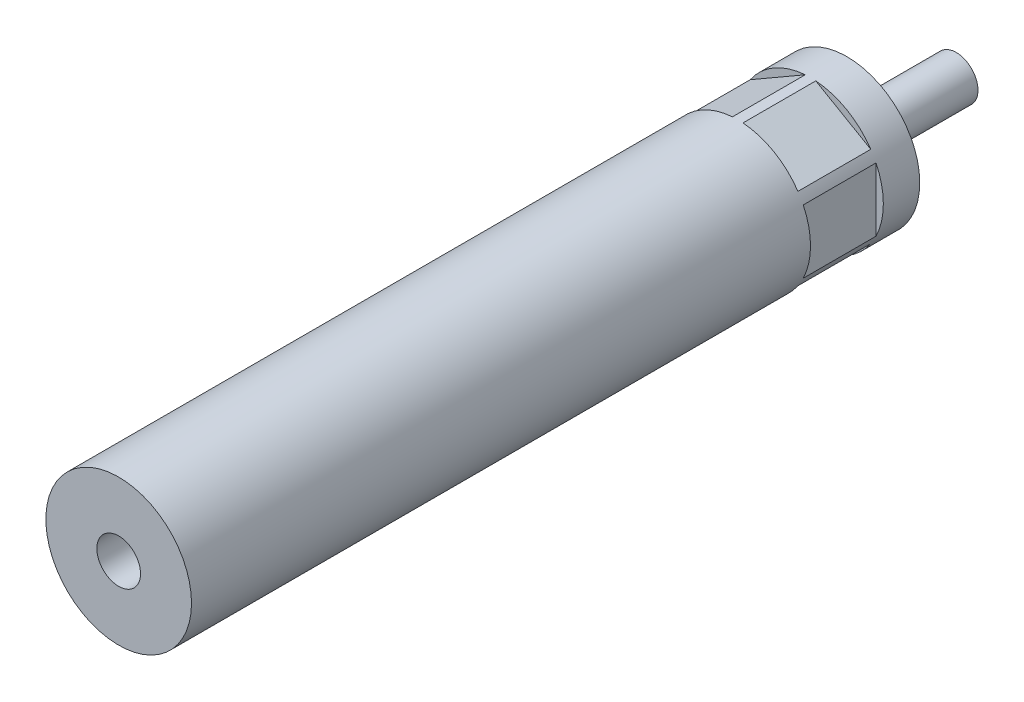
ISO-10303-21;
HEADER;
FILE_DESCRIPTION(('STEP AP214'),'2;1');
FILE_NAME('part.step','',(''),(''),'','','');
FILE_SCHEMA(('AUTOMOTIVE_DESIGN { 1 0 10303 214 1 1 1 1 }'));
ENDSEC;
DATA;
#1=APPLICATION_CONTEXT('core data for automotive mechanical design processes');
#2=APPLICATION_PROTOCOL_DEFINITION('international standard','automotive_design',2000,#1);
#3=PRODUCT_CONTEXT('',#1,'mechanical');
#4=PRODUCT('Part','Part','',(#3));
#5=PRODUCT_RELATED_PRODUCT_CATEGORY('part','',(#4));
#6=PRODUCT_DEFINITION_FORMATION('','',#4);
#7=PRODUCT_DEFINITION_CONTEXT('part definition',#1,'design');
#8=PRODUCT_DEFINITION('design','',#6,#7);
#9=PRODUCT_DEFINITION_SHAPE('','',#8);
#10=(LENGTH_UNIT() NAMED_UNIT(*) SI_UNIT(.MILLI.,.METRE.));
#11=(NAMED_UNIT(*) PLANE_ANGLE_UNIT() SI_UNIT($,.RADIAN.));
#12=(NAMED_UNIT(*) SI_UNIT($,.STERADIAN.) SOLID_ANGLE_UNIT());
#13=UNCERTAINTY_MEASURE_WITH_UNIT(LENGTH_MEASURE(1.E-05),#10,'distance_accuracy_value','');
#14=(GEOMETRIC_REPRESENTATION_CONTEXT(3) GLOBAL_UNCERTAINTY_ASSIGNED_CONTEXT((#13)) GLOBAL_UNIT_ASSIGNED_CONTEXT((#10,
#11,#12)) REPRESENTATION_CONTEXT('',''));
#15=CARTESIAN_POINT('',(0.,0.,0.));
#16=DIRECTION('',(0.,0.,1.));
#17=DIRECTION('',(1.,0.,0.));
#18=AXIS2_PLACEMENT_3D('',#15,#16,#17);
#19=CARTESIAN_POINT('',(0.,0.,80.));
#20=DIRECTION('',(0.,0.,1.));
#21=DIRECTION('',(1.,0.,0.));
#22=AXIS2_PLACEMENT_3D('',#19,#20,#21);
#23=CYLINDRICAL_SURFACE('',#22,20.);
#24=CARTESIAN_POINT('',(0.,0.,10.));
#25=DIRECTION('',(0.,0.,1.));
#26=DIRECTION('',(1.,0.,0.));
#27=AXIS2_PLACEMENT_3D('',#24,#25,#26);
#28=CIRCLE('',#27,20.);
#29=CARTESIAN_POINT('',(-16.5498344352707,-11.2295583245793,10.));
#30=VERTEX_POINT('',#29);
#31=CARTESIAN_POINT('',(-1.45016556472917,-19.9473562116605,10.));
#32=VERTEX_POINT('',#31);
#33=EDGE_CURVE('E152',#30,#32,#28,.T.);
#34=ORIENTED_EDGE('',*,*,#33,.F.);
#35=DIRECTION('',(0.,0.,1.));
#36=VECTOR('',#35,1.);
#37=CARTESIAN_POINT('',(-16.5498344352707,-11.2295583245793,80.));
#38=LINE('',#37,#36);
#39=CARTESIAN_POINT('',(-16.5498344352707,-11.2295583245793,30.));
#40=VERTEX_POINT('',#39);
#41=EDGE_CURVE('E9',#30,#40,#38,.T.);
#42=ORIENTED_EDGE('',*,*,#41,.T.);
#43=CARTESIAN_POINT('',(0.,0.,30.));
#44=DIRECTION('',(0.,0.,1.));
#45=DIRECTION('',(1.,0.,0.));
#46=AXIS2_PLACEMENT_3D('',#43,#44,#45);
#47=CIRCLE('',#46,20.);
#48=CARTESIAN_POINT('',(-1.45016556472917,-19.9473562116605,30.));
#49=VERTEX_POINT('',#48);
#50=EDGE_CURVE('E22',#40,#49,#47,.T.);
#51=ORIENTED_EDGE('',*,*,#50,.T.);
#52=DIRECTION('',(0.,0.,1.));
#53=VECTOR('',#52,1.);
#54=CARTESIAN_POINT('',(-1.45016556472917,-19.9473562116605,80.));
#55=LINE('',#54,#53);
#56=EDGE_CURVE('E149',#49,#32,#55,.F.);
#57=ORIENTED_EDGE('',*,*,#56,.T.);
#58=EDGE_LOOP('',(#34,#42,#51,#57));
#59=FACE_BOUND('',#58,.T.);
#60=DIRECTION('',(0.,0.,1.));
#61=VECTOR('',#60,1.);
#62=CARTESIAN_POINT('',(18.,8.71779788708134,80.));
#63=LINE('',#62,#61);
#64=CARTESIAN_POINT('',(18.,8.71779788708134,10.));
#65=VERTEX_POINT('',#64);
#66=CARTESIAN_POINT('',(18.,8.71779788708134,30.));
#67=VERTEX_POINT('',#66);
#68=EDGE_CURVE('E142',#65,#67,#63,.T.);
#69=ORIENTED_EDGE('',*,*,#68,.F.);
#70=CARTESIAN_POINT('',(18.,-8.71779788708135,10.));
#71=VERTEX_POINT('',#70);
#72=EDGE_CURVE('E141',#71,#65,#28,.T.);
#73=ORIENTED_EDGE('',*,*,#72,.F.);
#74=DIRECTION('',(0.,0.,1.));
#75=VECTOR('',#74,1.);
#76=CARTESIAN_POINT('',(18.,-8.71779788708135,80.));
#77=LINE('',#76,#75);
#78=CARTESIAN_POINT('',(18.,-8.71779788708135,30.));
#79=VERTEX_POINT('',#78);
#80=EDGE_CURVE('E138',#79,#71,#77,.F.);
#81=ORIENTED_EDGE('',*,*,#80,.F.);
#82=EDGE_CURVE('E145',#79,#67,#47,.T.);
#83=ORIENTED_EDGE('',*,*,#82,.T.);
#84=EDGE_LOOP('',(#69,#73,#81,#83));
#85=FACE_BOUND('',#84,.T.);
#86=CARTESIAN_POINT('',(16.5498344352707,11.2295583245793,10.));
#87=VERTEX_POINT('',#86);
#88=CARTESIAN_POINT('',(1.45016556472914,19.9473562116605,10.));
#89=VERTEX_POINT('',#88);
#90=EDGE_CURVE('E134',#87,#89,#28,.T.);
#91=ORIENTED_EDGE('',*,*,#90,.F.);
#92=DIRECTION('',(0.,0.,1.));
#93=VECTOR('',#92,1.);
#94=CARTESIAN_POINT('',(16.5498344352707,11.2295583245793,80.));
#95=LINE('',#94,#93);
#96=CARTESIAN_POINT('',(16.5498344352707,11.2295583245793,30.));
#97=VERTEX_POINT('',#96);
#98=EDGE_CURVE('E135',#87,#97,#95,.T.);
#99=ORIENTED_EDGE('',*,*,#98,.T.);
#100=CARTESIAN_POINT('',(1.45016556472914,19.9473562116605,30.));
#101=VERTEX_POINT('',#100);
#102=EDGE_CURVE('E139',#97,#101,#47,.T.);
#103=ORIENTED_EDGE('',*,*,#102,.T.);
#104=DIRECTION('',(0.,0.,1.));
#105=VECTOR('',#104,1.);
#106=CARTESIAN_POINT('',(1.45016556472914,19.9473562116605,80.));
#107=LINE('',#106,#105);
#108=EDGE_CURVE('E131',#101,#89,#107,.F.);
#109=ORIENTED_EDGE('',*,*,#108,.T.);
#110=EDGE_LOOP('',(#91,#99,#103,#109));
#111=FACE_BOUND('',#110,.T.);
#112=CARTESIAN_POINT('',(0.,0.,0.));
#113=DIRECTION('',(0.,0.,1.));
#114=DIRECTION('',(1.,0.,0.));
#115=AXIS2_PLACEMENT_3D('',#112,#113,#114);
#116=CIRCLE('',#115,20.);
#117=CARTESIAN_POINT('',(20.,0.,0.));
#118=VERTEX_POINT('',#117);
#119=EDGE_CURVE('E204',#118,#118,#116,.T.);
#120=ORIENTED_EDGE('',*,*,#119,.T.);
#121=EDGE_LOOP('',(#120));
#122=FACE_BOUND('',#121,.T.);
#123=CARTESIAN_POINT('',(0.,0.,200.));
#124=DIRECTION('',(0.,0.,1.));
#125=DIRECTION('',(1.,0.,0.));
#126=AXIS2_PLACEMENT_3D('',#123,#124,#125);
#127=CIRCLE('',#126,20.);
#128=CARTESIAN_POINT('',(20.,0.,200.));
#129=VERTEX_POINT('',#128);
#130=EDGE_CURVE('E201',#129,#129,#127,.T.);
#131=ORIENTED_EDGE('',*,*,#130,.F.);
#132=EDGE_LOOP('',(#131));
#133=FACE_BOUND('',#132,.T.);
#134=CARTESIAN_POINT('',(-18.,8.71779788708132,10.));
#135=VERTEX_POINT('',#134);
#136=CARTESIAN_POINT('',(-18.,-8.71779788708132,10.));
#137=VERTEX_POINT('',#136);
#138=EDGE_CURVE('E111',#135,#137,#28,.T.);
#139=ORIENTED_EDGE('',*,*,#138,.F.);
#140=DIRECTION('',(0.,0.,1.));
#141=VECTOR('',#140,1.);
#142=CARTESIAN_POINT('',(-18.,8.71779788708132,80.));
#143=LINE('',#142,#141);
#144=CARTESIAN_POINT('',(-18.,8.71779788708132,30.));
#145=VERTEX_POINT('',#144);
#146=EDGE_CURVE('E110',#135,#145,#143,.T.);
#147=ORIENTED_EDGE('',*,*,#146,.T.);
#148=CARTESIAN_POINT('',(-18.,-8.71779788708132,30.));
#149=VERTEX_POINT('',#148);
#150=EDGE_CURVE('E103',#145,#149,#47,.T.);
#151=ORIENTED_EDGE('',*,*,#150,.T.);
#152=DIRECTION('',(0.,0.,1.));
#153=VECTOR('',#152,1.);
#154=CARTESIAN_POINT('',(-18.,-8.71779788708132,80.));
#155=LINE('',#154,#153);
#156=EDGE_CURVE('E117',#149,#137,#155,.F.);
#157=ORIENTED_EDGE('',*,*,#156,.T.);
#158=EDGE_LOOP('',(#139,#147,#151,#157));
#159=FACE_BOUND('',#158,.T.);
#160=DIRECTION('',(0.,0.,1.));
#161=VECTOR('',#160,1.);
#162=CARTESIAN_POINT('',(-16.5498344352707,11.2295583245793,80.));
#163=LINE('',#162,#161);
#164=CARTESIAN_POINT('',(-16.5498344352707,11.2295583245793,10.));
#165=VERTEX_POINT('',#164);
#166=CARTESIAN_POINT('',(-16.5498344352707,11.2295583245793,30.));
#167=VERTEX_POINT('',#166);
#168=EDGE_CURVE('E129',#165,#167,#163,.T.);
#169=ORIENTED_EDGE('',*,*,#168,.F.);
#170=CARTESIAN_POINT('',(-1.45016556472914,19.9473562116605,10.));
#171=VERTEX_POINT('',#170);
#172=EDGE_CURVE('E125',#171,#165,#28,.T.);
#173=ORIENTED_EDGE('',*,*,#172,.F.);
#174=DIRECTION('',(0.,0.,1.));
#175=VECTOR('',#174,1.);
#176=CARTESIAN_POINT('',(-1.45016556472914,19.9473562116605,80.));
#177=LINE('',#176,#175);
#178=CARTESIAN_POINT('',(-1.45016556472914,19.9473562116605,30.));
#179=VERTEX_POINT('',#178);
#180=EDGE_CURVE('E123',#179,#171,#177,.F.);
#181=ORIENTED_EDGE('',*,*,#180,.F.);
#182=EDGE_CURVE('E113',#179,#167,#47,.T.);
#183=ORIENTED_EDGE('',*,*,#182,.T.);
#184=EDGE_LOOP('',(#169,#173,#181,#183));
#185=FACE_BOUND('',#184,.T.);
#186=DIRECTION('',(0.,0.,1.));
#187=VECTOR('',#186,1.);
#188=CARTESIAN_POINT('',(16.5498344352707,-11.2295583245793,80.));
#189=LINE('',#188,#187);
#190=CARTESIAN_POINT('',(16.5498344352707,-11.2295583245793,10.));
#191=VERTEX_POINT('',#190);
#192=CARTESIAN_POINT('',(16.5498344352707,-11.2295583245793,30.));
#193=VERTEX_POINT('',#192);
#194=EDGE_CURVE('E148',#191,#193,#189,.T.);
#195=ORIENTED_EDGE('',*,*,#194,.F.);
#196=CARTESIAN_POINT('',(1.45016556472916,-19.9473562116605,10.));
#197=VERTEX_POINT('',#196);
#198=EDGE_CURVE('E147',#197,#191,#28,.T.);
#199=ORIENTED_EDGE('',*,*,#198,.F.);
#200=DIRECTION('',(0.,0.,1.));
#201=VECTOR('',#200,1.);
#202=CARTESIAN_POINT('',(1.45016556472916,-19.9473562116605,80.));
#203=LINE('',#202,#201);
#204=CARTESIAN_POINT('',(1.45016556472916,-19.9473562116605,30.));
#205=VERTEX_POINT('',#204);
#206=EDGE_CURVE('E144',#205,#197,#203,.F.);
#207=ORIENTED_EDGE('',*,*,#206,.F.);
#208=EDGE_CURVE('E150',#205,#193,#47,.T.);
#209=ORIENTED_EDGE('',*,*,#208,.T.);
#210=EDGE_LOOP('',(#195,#199,#207,#209));
#211=FACE_BOUND('',#210,.T.);
#212=ADVANCED_FACE('F14',(#59,#85,#111,#122,#133,#159,#185,#211),#23,.T.);
#213=CARTESIAN_POINT('',(0.,0.,-30.));
#214=DIRECTION('',(0.,0.,1.));
#215=DIRECTION('',(1.,0.,0.));
#216=AXIS2_PLACEMENT_3D('',#213,#214,#215);
#217=PLANE('',#216);
#218=CARTESIAN_POINT('',(0.,0.,-30.));
#219=DIRECTION('',(0.,0.,1.));
#220=DIRECTION('',(1.,0.,0.));
#221=AXIS2_PLACEMENT_3D('',#218,#219,#220);
#222=CIRCLE('',#221,6.);
#223=CARTESIAN_POINT('',(6.,0.,-30.));
#224=VERTEX_POINT('',#223);
#225=EDGE_CURVE('E159',#224,#224,#222,.T.);
#226=ORIENTED_EDGE('',*,*,#225,.F.);
#227=EDGE_LOOP('',(#226));
#228=FACE_BOUND('',#227,.T.);
#229=ADVANCED_FACE('F16',(#228),#217,.F.);
#230=CARTESIAN_POINT('',(0.,0.,80.));
#231=DIRECTION('',(0.,0.,1.));
#232=DIRECTION('',(1.,0.,0.));
#233=AXIS2_PLACEMENT_3D('',#230,#231,#232);
#234=CYLINDRICAL_SURFACE('',#233,6.);
#235=CARTESIAN_POINT('',(0.,0.,-3.5));
#236=DIRECTION('',(0.,0.,1.));
#237=DIRECTION('',(1.,0.,0.));
#238=AXIS2_PLACEMENT_3D('',#235,#236,#237);
#239=CIRCLE('',#238,6.);
#240=CARTESIAN_POINT('',(6.,0.,-3.5));
#241=VERTEX_POINT('',#240);
#242=EDGE_CURVE('E213',#241,#241,#239,.T.);
#243=ORIENTED_EDGE('',*,*,#242,.F.);
#244=EDGE_LOOP('',(#243));
#245=FACE_BOUND('',#244,.T.);
#246=ORIENTED_EDGE('',*,*,#225,.T.);
#247=EDGE_LOOP('',(#246));
#248=FACE_BOUND('',#247,.T.);
#249=ADVANCED_FACE('F219',(#245,#248),#234,.T.);
#250=CARTESIAN_POINT('',(4.7,0.,-3.5));
#251=DIRECTION('',(0.,0.,1.));
#252=DIRECTION('',(1.,0.,0.));
#253=AXIS2_PLACEMENT_3D('',#250,#251,#252);
#254=PLANE('',#253);
#255=ORIENTED_EDGE('',*,*,#242,.T.);
#256=EDGE_LOOP('',(#255));
#257=FACE_BOUND('',#256,.T.);
#258=CARTESIAN_POINT('',(0.,0.,-3.5));
#259=DIRECTION('',(0.,0.,1.));
#260=DIRECTION('',(1.,0.,0.));
#261=AXIS2_PLACEMENT_3D('',#258,#259,#260);
#262=CIRCLE('',#261,4.7);
#263=CARTESIAN_POINT('',(4.7,0.,-3.5));
#264=VERTEX_POINT('',#263);
#265=EDGE_CURVE('E210',#264,#264,#262,.T.);
#266=ORIENTED_EDGE('',*,*,#265,.F.);
#267=EDGE_LOOP('',(#266));
#268=FACE_BOUND('',#267,.T.);
#269=ADVANCED_FACE('F228',(#257,#268),#254,.T.);
#270=CARTESIAN_POINT('',(0.,0.,80.));
#271=DIRECTION('',(0.,0.,1.));
#272=DIRECTION('',(1.,0.,0.));
#273=AXIS2_PLACEMENT_3D('',#270,#271,#272);
#274=CYLINDRICAL_SURFACE('',#273,4.7);
#275=ORIENTED_EDGE('',*,*,#265,.T.);
#276=EDGE_LOOP('',(#275));
#277=FACE_BOUND('',#276,.T.);
#278=CARTESIAN_POINT('',(0.,0.,0.));
#279=DIRECTION('',(0.,0.,1.));
#280=DIRECTION('',(1.,0.,0.));
#281=AXIS2_PLACEMENT_3D('',#278,#279,#280);
#282=CIRCLE('',#281,4.7);
#283=CARTESIAN_POINT('',(4.7,0.,0.));
#284=VERTEX_POINT('',#283);
#285=EDGE_CURVE('E207',#284,#284,#282,.T.);
#286=ORIENTED_EDGE('',*,*,#285,.F.);
#287=EDGE_LOOP('',(#286));
#288=FACE_BOUND('',#287,.T.);
#289=ADVANCED_FACE('F241',(#277,#288),#274,.T.);
#290=CARTESIAN_POINT('',(20.,0.,0.));
#291=DIRECTION('',(0.,0.,-1.));
#292=DIRECTION('',(-1.,0.,0.));
#293=AXIS2_PLACEMENT_3D('',#290,#291,#292);
#294=PLANE('',#293);
#295=ORIENTED_EDGE('',*,*,#285,.T.);
#296=EDGE_LOOP('',(#295));
#297=FACE_BOUND('',#296,.T.);
#298=ORIENTED_EDGE('',*,*,#119,.F.);
#299=EDGE_LOOP('',(#298));
#300=FACE_BOUND('',#299,.T.);
#301=ADVANCED_FACE('F238',(#297,#300),#294,.T.);
#302=CARTESIAN_POINT('',(20.,0.,200.));
#303=DIRECTION('',(0.,0.,-1.));
#304=DIRECTION('',(-1.,0.,0.));
#305=AXIS2_PLACEMENT_3D('',#302,#303,#304);
#306=PLANE('',#305);
#307=CARTESIAN_POINT('',(0.,0.,200.));
#308=DIRECTION('',(0.,0.,1.));
#309=DIRECTION('',(1.,0.,0.));
#310=AXIS2_PLACEMENT_3D('',#307,#308,#309);
#311=CIRCLE('',#310,6.);
#312=CARTESIAN_POINT('',(6.,0.,200.));
#313=VERTEX_POINT('',#312);
#314=EDGE_CURVE('E190',#313,#313,#311,.T.);
#315=ORIENTED_EDGE('',*,*,#314,.F.);
#316=EDGE_LOOP('',(#315));
#317=FACE_BOUND('',#316,.T.);
#318=ORIENTED_EDGE('',*,*,#130,.T.);
#319=EDGE_LOOP('',(#318));
#320=FACE_BOUND('',#319,.T.);
#321=ADVANCED_FACE('F236',(#317,#320),#306,.F.);
#322=CARTESIAN_POINT('',(0.,0.,80.));
#323=DIRECTION('',(0.,0.,1.));
#324=DIRECTION('',(1.,0.,0.));
#325=AXIS2_PLACEMENT_3D('',#322,#323,#324);
#326=CYLINDRICAL_SURFACE('',#325,6.);
#327=CARTESIAN_POINT('',(0.,0.,165.));
#328=DIRECTION('',(0.,0.,1.));
#329=DIRECTION('',(1.,0.,0.));
#330=AXIS2_PLACEMENT_3D('',#327,#328,#329);
#331=CIRCLE('',#330,6.);
#332=CARTESIAN_POINT('',(6.,0.,165.));
#333=VERTEX_POINT('',#332);
#334=EDGE_CURVE('E318',#333,#333,#331,.T.);
#335=ORIENTED_EDGE('',*,*,#334,.F.);
#336=EDGE_LOOP('',(#335));
#337=FACE_BOUND('',#336,.T.);
#338=ORIENTED_EDGE('',*,*,#314,.T.);
#339=EDGE_LOOP('',(#338));
#340=FACE_BOUND('',#339,.T.);
#341=ADVANCED_FACE('F263',(#337,#340),#326,.F.);
#342=CARTESIAN_POINT('',(-18.,10.3923048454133,30.));
#343=DIRECTION('',(1.,0.,0.));
#344=DIRECTION('',(0.,1.,0.));
#345=AXIS2_PLACEMENT_3D('',#342,#343,#344);
#346=PLANE('',#345);
#347=DIRECTION('',(0.,-1.,0.));
#348=VECTOR('',#347,1.);
#349=CARTESIAN_POINT('',(-18.,10.3923048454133,10.));
#350=LINE('',#349,#348);
#351=EDGE_CURVE('E319',#135,#137,#350,.T.);
#352=ORIENTED_EDGE('',*,*,#351,.T.);
#353=ORIENTED_EDGE('',*,*,#156,.F.);
#354=DIRECTION('',(0.,-1.,0.));
#355=VECTOR('',#354,1.);
#356=CARTESIAN_POINT('',(-18.,10.3923048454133,30.));
#357=LINE('',#356,#355);
#358=EDGE_CURVE('E106',#145,#149,#357,.T.);
#359=ORIENTED_EDGE('',*,*,#358,.F.);
#360=ORIENTED_EDGE('',*,*,#146,.F.);
#361=EDGE_LOOP('',(#352,#353,#359,#360));
#362=FACE_BOUND('',#361,.T.);
#363=ADVANCED_FACE('F115',(#362),#346,.F.);
#364=CARTESIAN_POINT('',(0.,0.,10.));
#365=DIRECTION('',(0.,0.,1.));
#366=DIRECTION('',(1.,0.,0.));
#367=AXIS2_PLACEMENT_3D('',#364,#365,#366);
#368=PLANE('',#367);
#369=ORIENTED_EDGE('',*,*,#138,.T.);
#370=ORIENTED_EDGE('',*,*,#351,.F.);
#371=EDGE_LOOP('',(#369,#370));
#372=FACE_BOUND('',#371,.T.);
#373=ADVANCED_FACE('F276',(#372),#368,.T.);
#374=CARTESIAN_POINT('',(0.,0.,30.));
#375=DIRECTION('',(0.,0.,1.));
#376=DIRECTION('',(1.,0.,0.));
#377=AXIS2_PLACEMENT_3D('',#374,#375,#376);
#378=PLANE('',#377);
#379=ORIENTED_EDGE('',*,*,#358,.T.);
#380=ORIENTED_EDGE('',*,*,#150,.F.);
#381=EDGE_LOOP('',(#379,#380));
#382=FACE_BOUND('',#381,.T.);
#383=ADVANCED_FACE('F105',(#382),#378,.F.);
#384=CARTESIAN_POINT('',(-18.,10.3923048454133,30.));
#385=DIRECTION('',(-0.5,0.866025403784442,0.));
#386=DIRECTION('',(-0.866025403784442,-0.5,0.));
#387=AXIS2_PLACEMENT_3D('',#384,#385,#386);
#388=PLANE('',#387);
#389=ORIENTED_EDGE('',*,*,#168,.T.);
#390=DIRECTION('',(0.866025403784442,0.5,0.));
#391=VECTOR('',#390,1.);
#392=CARTESIAN_POINT('',(-18.,10.3923048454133,30.));
#393=LINE('',#392,#391);
#394=EDGE_CURVE('E118',#167,#179,#393,.T.);
#395=ORIENTED_EDGE('',*,*,#394,.T.);
#396=ORIENTED_EDGE('',*,*,#180,.T.);
#397=DIRECTION('',(0.866025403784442,0.5,0.));
#398=VECTOR('',#397,1.);
#399=CARTESIAN_POINT('',(-18.,10.3923048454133,10.));
#400=LINE('',#399,#398);
#401=EDGE_CURVE('E321',#165,#171,#400,.T.);
#402=ORIENTED_EDGE('',*,*,#401,.F.);
#403=EDGE_LOOP('',(#389,#395,#396,#402));
#404=FACE_BOUND('',#403,.T.);
#405=ADVANCED_FACE('F303',(#404),#388,.T.);
#406=ORIENTED_EDGE('',*,*,#172,.T.);
#407=ORIENTED_EDGE('',*,*,#401,.T.);
#408=EDGE_LOOP('',(#406,#407));
#409=FACE_BOUND('',#408,.T.);
#410=ADVANCED_FACE('F291',(#409),#368,.T.);
#411=ORIENTED_EDGE('',*,*,#394,.F.);
#412=ORIENTED_EDGE('',*,*,#182,.F.);
#413=EDGE_LOOP('',(#411,#412));
#414=FACE_BOUND('',#413,.T.);
#415=ADVANCED_FACE('F286',(#414),#378,.F.);
#416=CARTESIAN_POINT('',(18.,10.3923048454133,30.));
#417=DIRECTION('',(-0.499999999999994,-0.866025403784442,0.));
#418=DIRECTION('',(0.866025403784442,-0.499999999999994,0.));
#419=AXIS2_PLACEMENT_3D('',#416,#417,#418);
#420=PLANE('',#419);
#421=DIRECTION('',(-0.866025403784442,0.499999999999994,0.));
#422=VECTOR('',#421,1.);
#423=CARTESIAN_POINT('',(18.,10.3923048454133,10.));
#424=LINE('',#423,#422);
#425=EDGE_CURVE('E329',#87,#89,#424,.T.);
#426=ORIENTED_EDGE('',*,*,#425,.T.);
#427=ORIENTED_EDGE('',*,*,#108,.F.);
#428=DIRECTION('',(-0.866025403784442,0.499999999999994,0.));
#429=VECTOR('',#428,1.);
#430=CARTESIAN_POINT('',(18.,10.3923048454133,30.));
#431=LINE('',#430,#429);
#432=EDGE_CURVE('E192',#97,#101,#431,.T.);
#433=ORIENTED_EDGE('',*,*,#432,.F.);
#434=ORIENTED_EDGE('',*,*,#98,.F.);
#435=EDGE_LOOP('',(#426,#427,#433,#434));
#436=FACE_BOUND('',#435,.T.);
#437=ADVANCED_FACE('F290',(#436),#420,.F.);
#438=ORIENTED_EDGE('',*,*,#90,.T.);
#439=ORIENTED_EDGE('',*,*,#425,.F.);
#440=EDGE_LOOP('',(#438,#439));
#441=FACE_BOUND('',#440,.T.);
#442=ADVANCED_FACE('F284',(#441),#368,.T.);
#443=ORIENTED_EDGE('',*,*,#432,.T.);
#444=ORIENTED_EDGE('',*,*,#102,.F.);
#445=EDGE_LOOP('',(#443,#444));
#446=FACE_BOUND('',#445,.T.);
#447=ADVANCED_FACE('F280',(#446),#378,.F.);
#448=CARTESIAN_POINT('',(18.,10.3923048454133,30.));
#449=DIRECTION('',(1.,0.,0.));
#450=DIRECTION('',(0.,1.,0.));
#451=AXIS2_PLACEMENT_3D('',#448,#449,#450);
#452=PLANE('',#451);
#453=ORIENTED_EDGE('',*,*,#68,.T.);
#454=DIRECTION('',(0.,-1.,0.));
#455=VECTOR('',#454,1.);
#456=CARTESIAN_POINT('',(18.,10.3923048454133,30.));
#457=LINE('',#456,#455);
#458=EDGE_CURVE('E187',#67,#79,#457,.T.);
#459=ORIENTED_EDGE('',*,*,#458,.T.);
#460=ORIENTED_EDGE('',*,*,#80,.T.);
#461=DIRECTION('',(0.,-1.,0.));
#462=VECTOR('',#461,1.);
#463=CARTESIAN_POINT('',(18.,10.3923048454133,10.));
#464=LINE('',#463,#462);
#465=EDGE_CURVE('E328',#65,#71,#464,.T.);
#466=ORIENTED_EDGE('',*,*,#465,.F.);
#467=EDGE_LOOP('',(#453,#459,#460,#466));
#468=FACE_BOUND('',#467,.T.);
#469=ADVANCED_FACE('F283',(#468),#452,.T.);
#470=ORIENTED_EDGE('',*,*,#72,.T.);
#471=ORIENTED_EDGE('',*,*,#465,.T.);
#472=EDGE_LOOP('',(#470,#471));
#473=FACE_BOUND('',#472,.T.);
#474=ADVANCED_FACE('F292',(#473),#368,.T.);
#475=ORIENTED_EDGE('',*,*,#458,.F.);
#476=ORIENTED_EDGE('',*,*,#82,.F.);
#477=EDGE_LOOP('',(#475,#476));
#478=FACE_BOUND('',#477,.T.);
#479=ADVANCED_FACE('F287',(#478),#378,.F.);
#480=CARTESIAN_POINT('',(18.,-10.3923048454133,30.));
#481=DIRECTION('',(0.5,-0.866025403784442,0.));
#482=DIRECTION('',(0.866025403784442,0.5,0.));
#483=AXIS2_PLACEMENT_3D('',#480,#481,#482);
#484=PLANE('',#483);
#485=ORIENTED_EDGE('',*,*,#194,.T.);
#486=DIRECTION('',(-0.866025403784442,-0.5,0.));
#487=VECTOR('',#486,1.);
#488=CARTESIAN_POINT('',(18.,-10.3923048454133,30.));
#489=LINE('',#488,#487);
#490=EDGE_CURVE('E37',#193,#205,#489,.T.);
#491=ORIENTED_EDGE('',*,*,#490,.T.);
#492=ORIENTED_EDGE('',*,*,#206,.T.);
#493=DIRECTION('',(-0.866025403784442,-0.5,0.));
#494=VECTOR('',#493,1.);
#495=CARTESIAN_POINT('',(18.,-10.3923048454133,10.));
#496=LINE('',#495,#494);
#497=EDGE_CURVE('E325',#191,#197,#496,.T.);
#498=ORIENTED_EDGE('',*,*,#497,.F.);
#499=EDGE_LOOP('',(#485,#491,#492,#498));
#500=FACE_BOUND('',#499,.T.);
#501=ADVANCED_FACE('F293',(#500),#484,.T.);
#502=ORIENTED_EDGE('',*,*,#198,.T.);
#503=ORIENTED_EDGE('',*,*,#497,.T.);
#504=EDGE_LOOP('',(#502,#503));
#505=FACE_BOUND('',#504,.T.);
#506=ADVANCED_FACE('F296',(#505),#368,.T.);
#507=ORIENTED_EDGE('',*,*,#490,.F.);
#508=ORIENTED_EDGE('',*,*,#208,.F.);
#509=EDGE_LOOP('',(#507,#508));
#510=FACE_BOUND('',#509,.T.);
#511=ADVANCED_FACE('F185',(#510),#378,.F.);
#512=DIRECTION('',(0.866025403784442,-0.5,0.));
#513=VECTOR('',#512,1.);
#514=CARTESIAN_POINT('',(-18.,-10.3923048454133,30.));
#515=LINE('',#514,#513);
#516=EDGE_CURVE('E186',#40,#49,#515,.T.);
#517=ORIENTED_EDGE('',*,*,#516,.T.);
#518=ORIENTED_EDGE('',*,*,#50,.F.);
#519=EDGE_LOOP('',(#517,#518));
#520=FACE_BOUND('',#519,.T.);
#521=ADVANCED_FACE('F342',(#520),#378,.F.);
#522=ORIENTED_EDGE('',*,*,#33,.T.);
#523=DIRECTION('',(0.866025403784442,-0.5,0.));
#524=VECTOR('',#523,1.);
#525=CARTESIAN_POINT('',(-18.,-10.3923048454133,10.));
#526=LINE('',#525,#524);
#527=EDGE_CURVE('E29',#30,#32,#526,.T.);
#528=ORIENTED_EDGE('',*,*,#527,.F.);
#529=EDGE_LOOP('',(#522,#528));
#530=FACE_BOUND('',#529,.T.);
#531=ADVANCED_FACE('F311',(#530),#368,.T.);
#532=CARTESIAN_POINT('',(-18.,-10.3923048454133,30.));
#533=DIRECTION('',(0.5,0.866025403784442,0.));
#534=DIRECTION('',(-0.866025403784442,0.5,0.));
#535=AXIS2_PLACEMENT_3D('',#532,#533,#534);
#536=PLANE('',#535);
#537=ORIENTED_EDGE('',*,*,#527,.T.);
#538=ORIENTED_EDGE('',*,*,#56,.F.);
#539=ORIENTED_EDGE('',*,*,#516,.F.);
#540=ORIENTED_EDGE('',*,*,#41,.F.);
#541=EDGE_LOOP('',(#537,#538,#539,#540));
#542=FACE_BOUND('',#541,.T.);
#543=ADVANCED_FACE('F307',(#542),#536,.F.);
#544=CARTESIAN_POINT('',(0.,0.,165.));
#545=DIRECTION('',(0.,0.,1.));
#546=DIRECTION('',(1.,0.,0.));
#547=AXIS2_PLACEMENT_3D('',#544,#545,#546);
#548=PLANE('',#547);
#549=ORIENTED_EDGE('',*,*,#334,.T.);
#550=EDGE_LOOP('',(#549));
#551=FACE_BOUND('',#550,.T.);
#552=ADVANCED_FACE('F310',(#551),#548,.T.);
#553=CLOSED_SHELL('',(#212,#229,#249,#269,#289,#301,#321,#341,#363,#373,#383,#405,#410,#415,
#437,#442,#447,#469,#474,#479,#501,#506,#511,#521,#531,#543,#552));
#554=MANIFOLD_SOLID_BREP('B1',#553);
#555=ADVANCED_BREP_SHAPE_REPRESENTATION('',(#18,#554),#14);
#556=SHAPE_DEFINITION_REPRESENTATION(#9,#555);
ENDSEC;
END-ISO-10303-21;
